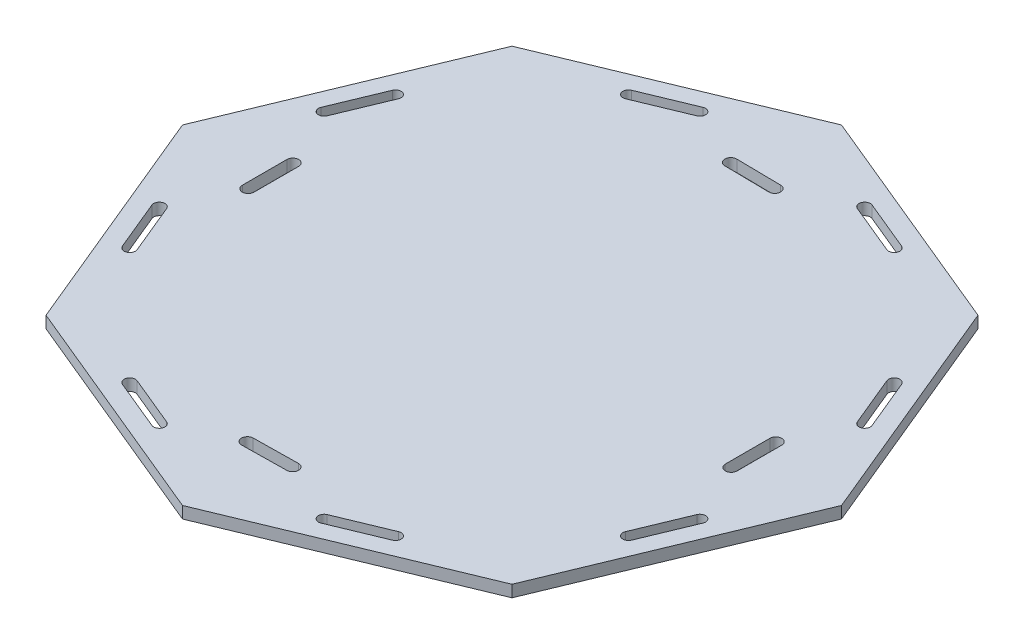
from build123d import *

# Parameters (mm, degrees)
BOSS_EXTRUDE1_DEPTH = 12.5


with BuildPart() as part:
    # Sketch1 → Boss-Extrude1 (new body)
    with BuildSketch(Plane(origin=(0, 0, 0), x_dir=(1, 0, 0), z_dir=(0, 1, 0))):
        Polygon((0, 350), (-247.487373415, 247.487373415), (-350, 0), (-247.487373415, -247.487373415), (0, -350), (247.487373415, -247.487373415), (350, 0), (247.487373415, 247.487373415), align=None)
        with BuildLine():
            Line((138.820665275, 259.362080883), (85.23565239, 281.55771996))
            ThreePointArc((85.23565239, 281.55771996), (81.988475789, 289.397097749), (89.827853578, 292.64427435))
            Line((89.827853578, 292.64427435), (143.412866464, 270.448635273))
            ThreePointArc((143.412866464, 270.448635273), (146.660043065, 262.609257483), (138.820665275, 259.362080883))
        make_face(mode=Mode.SUBTRACT)
        with BuildLine():
            Line((-85.23565239, 281.55771996), (-138.820665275, 259.362080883))
            ThreePointArc((-138.820665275, 259.362080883), (-146.660043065, 262.609257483), (-143.412866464, 270.448635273))
            Line((-143.412866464, 270.448635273), (-89.827853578, 292.64427435))
            ThreePointArc((-89.827853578, 292.64427435), (-81.988475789, 289.397097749), (-85.23565239, 281.55771996))
        make_face(mode=Mode.SUBTRACT)
        with BuildLine():
            Line((281.55771996, 85.23565239), (259.362080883, 138.820665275))
            ThreePointArc((259.362080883, 138.820665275), (262.609257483, 146.660043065), (270.448635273, 143.412866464))
            Line((270.448635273, 143.412866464), (292.64427435, 89.827853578))
            ThreePointArc((292.64427435, 89.827853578), (289.397097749, 81.988475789), (281.55771996, 85.23565239))
        make_face(mode=Mode.SUBTRACT)
        with BuildLine():
            Line((259.362080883, -138.820665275), (281.55771996, -85.23565239))
            ThreePointArc((281.55771996, -85.23565239), (289.397097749, -81.988475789), (292.64427435, -89.827853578))
            Line((292.64427435, -89.827853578), (270.448635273, -143.412866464))
            ThreePointArc((270.448635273, -143.412866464), (262.609257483, -146.660043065), (259.362080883, -138.820665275))
        make_face(mode=Mode.SUBTRACT)
        with BuildLine():
            Line((85.23565239, -281.55771996), (138.820665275, -259.362080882))
            ThreePointArc((138.820665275, -259.362080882), (146.660043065, -262.609257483), (143.412866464, -270.448635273))
            Line((143.412866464, -270.448635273), (89.827853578, -292.64427435))
            ThreePointArc((89.827853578, -292.64427435), (81.988475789, -289.397097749), (85.23565239, -281.55771996))
        make_face(mode=Mode.SUBTRACT)
        with BuildLine():
            Line((-138.820665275, -259.362080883), (-85.23565239, -281.55771996))
            ThreePointArc((-85.23565239, -281.55771996), (-81.988475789, -289.397097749), (-89.827853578, -292.64427435))
            Line((-89.827853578, -292.64427435), (-143.412866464, -270.448635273))
            ThreePointArc((-143.412866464, -270.448635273), (-146.660043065, -262.609257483), (-138.820665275, -259.362080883))
        make_face(mode=Mode.SUBTRACT)
        with BuildLine():
            Line((-281.55771996, -85.23565239), (-259.362080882, -138.820665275))
            ThreePointArc((-259.362080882, -138.820665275), (-262.609257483, -146.660043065), (-270.448635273, -143.412866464))
            Line((-270.448635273, -143.412866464), (-292.64427435, -89.827853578))
            ThreePointArc((-292.64427435, -89.827853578), (-289.397097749, -81.988475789), (-281.55771996, -85.23565239))
        make_face(mode=Mode.SUBTRACT)
        with BuildLine():
            Line((-259.362080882, 138.820665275), (-281.55771996, 85.23565239))
            ThreePointArc((-281.55771996, 85.23565239), (-289.397097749, 81.988475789), (-292.64427435, 89.827853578))
            Line((-292.64427435, 89.827853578), (-270.448635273, 143.412866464))
            ThreePointArc((-270.448635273, 143.412866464), (-262.609257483, 146.660043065), (-259.362080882, 138.820665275))
        make_face(mode=Mode.SUBTRACT)
        with BuildLine():
            Line((-24.265876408, 263.037327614), (23.12873066, 262.322330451))
            ThreePointArc((23.12873066, 262.322330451), (29.332982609, 255.928015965), (22.938668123, 249.723764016))
            Line((22.938668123, 249.723764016), (-24.455938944, 250.438761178))
            ThreePointArc((-24.455938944, 250.438761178), (-30.660190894, 256.833075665), (-24.265876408, 263.037327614))
        make_face(mode=Mode.SUBTRACT)
        with BuildLine():
            Line((-262.80387771, -23.7), (-262.80387771, 23.7))
            ThreePointArc((-262.80387771, 23.7), (-256.50387771, 30), (-250.20387771, 23.7))
            Line((-250.20387771, 23.7), (-250.20387771, -23.7))
            ThreePointArc((-250.20387771, -23.7), (-256.50387771, -30), (-262.80387771, -23.7))
        make_face(mode=Mode.SUBTRACT)
        with BuildLine():
            Line((262.80387771, -23.7), (262.80387771, 23.7))
            ThreePointArc((262.80387771, 23.7), (256.50387771, 30), (250.20387771, 23.7))
            Line((250.20387771, 23.7), (250.20387771, -23.7))
            ThreePointArc((250.20387771, -23.7), (256.50387771, -30), (262.80387771, -23.7))
        make_face(mode=Mode.SUBTRACT)
        with BuildLine():
            Line((-24.265876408, -263.037327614), (23.12873066, -262.322330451))
            ThreePointArc((23.12873066, -262.322330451), (29.332982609, -255.928015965), (22.938668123, -249.723764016))
            Line((22.938668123, -249.723764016), (-24.455938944, -250.438761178))
            ThreePointArc((-24.455938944, -250.438761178), (-30.660190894, -256.833075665), (-24.265876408, -263.037327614))
        make_face(mode=Mode.SUBTRACT)
    extrude(amount=BOSS_EXTRUDE1_DEPTH)


solid = part.part
